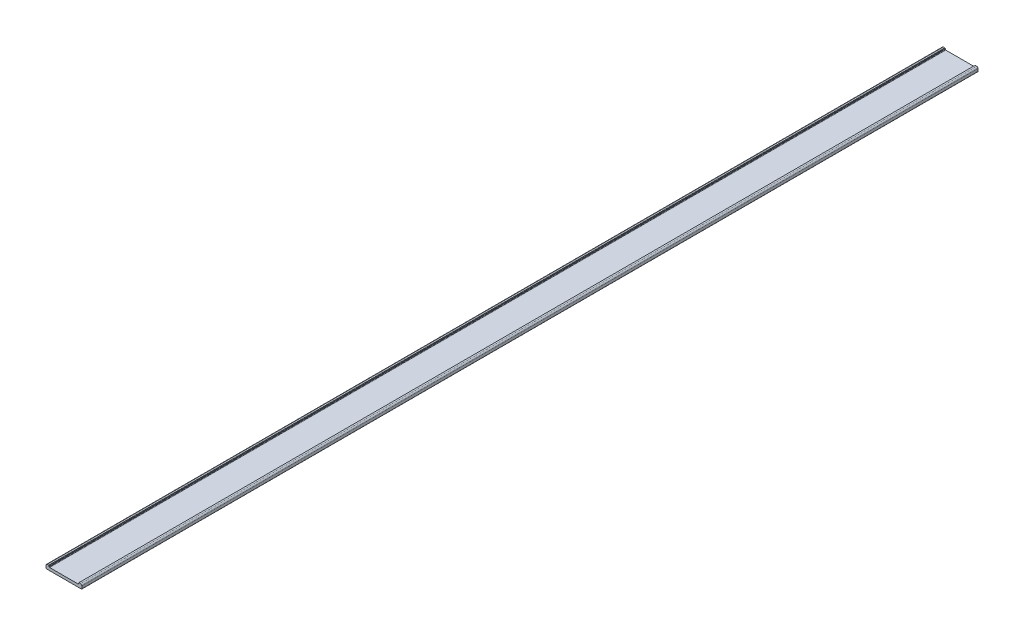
ISO-10303-21;
HEADER;
FILE_DESCRIPTION(('STEP AP214'),'2;1');
FILE_NAME('part.step','',(''),(''),'','','');
FILE_SCHEMA(('AUTOMOTIVE_DESIGN { 1 0 10303 214 1 1 1 1 }'));
ENDSEC;
DATA;
#1=APPLICATION_CONTEXT('core data for automotive mechanical design processes');
#2=APPLICATION_PROTOCOL_DEFINITION('international standard','automotive_design',2000,#1);
#3=PRODUCT_CONTEXT('',#1,'mechanical');
#4=PRODUCT('Part','Part','',(#3));
#5=PRODUCT_RELATED_PRODUCT_CATEGORY('part','',(#4));
#6=PRODUCT_DEFINITION_FORMATION('','',#4);
#7=PRODUCT_DEFINITION_CONTEXT('part definition',#1,'design');
#8=PRODUCT_DEFINITION('design','',#6,#7);
#9=PRODUCT_DEFINITION_SHAPE('','',#8);
#10=(LENGTH_UNIT() NAMED_UNIT(*) SI_UNIT(.MILLI.,.METRE.));
#11=(NAMED_UNIT(*) PLANE_ANGLE_UNIT() SI_UNIT($,.RADIAN.));
#12=(NAMED_UNIT(*) SI_UNIT($,.STERADIAN.) SOLID_ANGLE_UNIT());
#13=UNCERTAINTY_MEASURE_WITH_UNIT(LENGTH_MEASURE(1.E-05),#10,'distance_accuracy_value','');
#14=(GEOMETRIC_REPRESENTATION_CONTEXT(3) GLOBAL_UNCERTAINTY_ASSIGNED_CONTEXT((#13)) GLOBAL_UNIT_ASSIGNED_CONTEXT((#10,
#11,#12)) REPRESENTATION_CONTEXT('',''));
#15=CARTESIAN_POINT('',(0.,0.,0.));
#16=DIRECTION('',(0.,0.,1.));
#17=DIRECTION('',(1.,0.,0.));
#18=AXIS2_PLACEMENT_3D('',#15,#16,#17);
#19=CARTESIAN_POINT('',(39.5,0.5,-1000.));
#20=DIRECTION('',(0.,0.,1.));
#21=DIRECTION('',(1.,0.,0.));
#22=AXIS2_PLACEMENT_3D('',#19,#20,#21);
#23=CYLINDRICAL_SURFACE('',#22,0.5);
#24=CARTESIAN_POINT('',(39.5,0.5,0.));
#25=DIRECTION('',(0.,0.,1.));
#26=DIRECTION('',(1.,0.,0.));
#27=AXIS2_PLACEMENT_3D('',#24,#25,#26);
#28=CIRCLE('',#27,0.5);
#29=CARTESIAN_POINT('',(39.5,0.,0.));
#30=VERTEX_POINT('',#29);
#31=CARTESIAN_POINT('',(40.,0.500000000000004,0.));
#32=VERTEX_POINT('',#31);
#33=EDGE_CURVE('E190',#30,#32,#28,.T.);
#34=ORIENTED_EDGE('',*,*,#33,.F.);
#35=DIRECTION('',(0.,0.,1.));
#36=VECTOR('',#35,1.);
#37=CARTESIAN_POINT('',(39.5,0.,-1000.));
#38=LINE('',#37,#36);
#39=CARTESIAN_POINT('',(39.5,0.,-1000.));
#40=VERTEX_POINT('',#39);
#41=EDGE_CURVE('E11',#40,#30,#38,.T.);
#42=ORIENTED_EDGE('',*,*,#41,.F.);
#43=CARTESIAN_POINT('',(39.5,0.5,-1000.));
#44=DIRECTION('',(0.,0.,1.));
#45=DIRECTION('',(1.,0.,0.));
#46=AXIS2_PLACEMENT_3D('',#43,#44,#45);
#47=CIRCLE('',#46,0.5);
#48=CARTESIAN_POINT('',(40.,0.500000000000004,-1000.));
#49=VERTEX_POINT('',#48);
#50=EDGE_CURVE('E234',#40,#49,#47,.T.);
#51=ORIENTED_EDGE('',*,*,#50,.T.);
#52=DIRECTION('',(0.,0.,1.));
#53=VECTOR('',#52,1.);
#54=CARTESIAN_POINT('',(40.,0.500000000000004,-1000.));
#55=LINE('',#54,#53);
#56=EDGE_CURVE('E46',#49,#32,#55,.T.);
#57=ORIENTED_EDGE('',*,*,#56,.T.);
#58=EDGE_LOOP('',(#34,#42,#51,#57));
#59=FACE_BOUND('',#58,.T.);
#60=ADVANCED_FACE('F43',(#59),#23,.T.);
#61=CARTESIAN_POINT('',(0.500000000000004,0.,-1000.));
#62=DIRECTION('',(0.,-1.,0.));
#63=DIRECTION('',(0.,0.,-1.));
#64=AXIS2_PLACEMENT_3D('',#61,#62,#63);
#65=PLANE('',#64);
#66=DIRECTION('',(1.,0.,0.));
#67=VECTOR('',#66,1.);
#68=CARTESIAN_POINT('',(0.500000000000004,0.,0.));
#69=LINE('',#68,#67);
#70=CARTESIAN_POINT('',(0.500000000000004,0.,0.));
#71=VERTEX_POINT('',#70);
#72=EDGE_CURVE('E232',#71,#30,#69,.T.);
#73=ORIENTED_EDGE('',*,*,#72,.F.);
#74=DIRECTION('',(0.,0.,1.));
#75=VECTOR('',#74,1.);
#76=CARTESIAN_POINT('',(0.500000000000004,0.,-1000.));
#77=LINE('',#76,#75);
#78=CARTESIAN_POINT('',(0.500000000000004,0.,-1000.));
#79=VERTEX_POINT('',#78);
#80=EDGE_CURVE('E53',#79,#71,#77,.T.);
#81=ORIENTED_EDGE('',*,*,#80,.F.);
#82=DIRECTION('',(1.,0.,0.));
#83=VECTOR('',#82,1.);
#84=CARTESIAN_POINT('',(0.500000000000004,0.,-1000.));
#85=LINE('',#84,#83);
#86=EDGE_CURVE('E180',#79,#40,#85,.T.);
#87=ORIENTED_EDGE('',*,*,#86,.T.);
#88=ORIENTED_EDGE('',*,*,#41,.T.);
#89=EDGE_LOOP('',(#73,#81,#87,#88));
#90=FACE_BOUND('',#89,.T.);
#91=ADVANCED_FACE('F276',(#90),#65,.T.);
#92=CARTESIAN_POINT('',(0.5,0.5,-1000.));
#93=DIRECTION('',(0.,0.,1.));
#94=DIRECTION('',(1.,0.,0.));
#95=AXIS2_PLACEMENT_3D('',#92,#93,#94);
#96=CYLINDRICAL_SURFACE('',#95,0.5);
#97=CARTESIAN_POINT('',(0.5,0.5,0.));
#98=DIRECTION('',(0.,0.,1.));
#99=DIRECTION('',(1.,0.,0.));
#100=AXIS2_PLACEMENT_3D('',#97,#98,#99);
#101=CIRCLE('',#100,0.5);
#102=CARTESIAN_POINT('',(0.,0.500000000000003,0.));
#103=VERTEX_POINT('',#102);
#104=EDGE_CURVE('E166',#103,#71,#101,.T.);
#105=ORIENTED_EDGE('',*,*,#104,.F.);
#106=DIRECTION('',(0.,0.,1.));
#107=VECTOR('',#106,1.);
#108=CARTESIAN_POINT('',(0.,0.500000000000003,-1000.));
#109=LINE('',#108,#107);
#110=CARTESIAN_POINT('',(0.,0.500000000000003,-1000.));
#111=VERTEX_POINT('',#110);
#112=EDGE_CURVE('E161',#111,#103,#109,.T.);
#113=ORIENTED_EDGE('',*,*,#112,.F.);
#114=CARTESIAN_POINT('',(0.5,0.5,-1000.));
#115=DIRECTION('',(0.,0.,1.));
#116=DIRECTION('',(1.,0.,0.));
#117=AXIS2_PLACEMENT_3D('',#114,#115,#116);
#118=CIRCLE('',#117,0.5);
#119=EDGE_CURVE('E164',#111,#79,#118,.T.);
#120=ORIENTED_EDGE('',*,*,#119,.T.);
#121=ORIENTED_EDGE('',*,*,#80,.T.);
#122=EDGE_LOOP('',(#105,#113,#120,#121));
#123=FACE_BOUND('',#122,.T.);
#124=ADVANCED_FACE('F163',(#123),#96,.T.);
#125=CARTESIAN_POINT('',(0.,0.500000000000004,-1000.));
#126=DIRECTION('',(-1.,0.,0.));
#127=DIRECTION('',(0.,0.,1.));
#128=AXIS2_PLACEMENT_3D('',#125,#126,#127);
#129=PLANE('',#128);
#130=DIRECTION('',(0.,-1.,0.));
#131=VECTOR('',#130,1.);
#132=CARTESIAN_POINT('',(0.,0.500000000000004,0.));
#133=LINE('',#132,#131);
#134=CARTESIAN_POINT('',(0.,3.3,0.));
#135=VERTEX_POINT('',#134);
#136=EDGE_CURVE('E229',#135,#103,#133,.T.);
#137=ORIENTED_EDGE('',*,*,#136,.F.);
#138=DIRECTION('',(0.,0.,1.));
#139=VECTOR('',#138,1.);
#140=CARTESIAN_POINT('',(0.,3.3,-1000.));
#141=LINE('',#140,#139);
#142=CARTESIAN_POINT('',(0.,3.3,-1000.));
#143=VERTEX_POINT('',#142);
#144=EDGE_CURVE('E172',#143,#135,#141,.T.);
#145=ORIENTED_EDGE('',*,*,#144,.F.);
#146=DIRECTION('',(0.,-1.,0.));
#147=VECTOR('',#146,1.);
#148=CARTESIAN_POINT('',(0.,0.500000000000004,-1000.));
#149=LINE('',#148,#147);
#150=EDGE_CURVE('E178',#143,#111,#149,.T.);
#151=ORIENTED_EDGE('',*,*,#150,.T.);
#152=ORIENTED_EDGE('',*,*,#112,.T.);
#153=EDGE_LOOP('',(#137,#145,#151,#152));
#154=FACE_BOUND('',#153,.T.);
#155=ADVANCED_FACE('F182',(#154),#129,.T.);
#156=CARTESIAN_POINT('',(1.5,3.3,-1000.));
#157=DIRECTION('',(0.,0.,1.));
#158=DIRECTION('',(1.,0.,0.));
#159=AXIS2_PLACEMENT_3D('',#156,#157,#158);
#160=CYLINDRICAL_SURFACE('',#159,1.5);
#161=CARTESIAN_POINT('',(1.5,3.3,0.));
#162=DIRECTION('',(0.,0.,1.));
#163=DIRECTION('',(-1.,0.,0.));
#164=AXIS2_PLACEMENT_3D('',#161,#162,#163);
#165=CIRCLE('',#164,1.5);
#166=CARTESIAN_POINT('',(1.5,4.8,0.));
#167=VERTEX_POINT('',#166);
#168=EDGE_CURVE('E226',#167,#135,#165,.T.);
#169=ORIENTED_EDGE('',*,*,#168,.F.);
#170=DIRECTION('',(0.,0.,1.));
#171=VECTOR('',#170,1.);
#172=CARTESIAN_POINT('',(1.5,4.8,-1000.));
#173=LINE('',#172,#171);
#174=CARTESIAN_POINT('',(1.5,4.8,-1000.));
#175=VERTEX_POINT('',#174);
#176=EDGE_CURVE('E240',#175,#167,#173,.T.);
#177=ORIENTED_EDGE('',*,*,#176,.F.);
#178=CARTESIAN_POINT('',(1.5,3.3,-1000.));
#179=DIRECTION('',(0.,0.,1.));
#180=DIRECTION('',(-1.,0.,0.));
#181=AXIS2_PLACEMENT_3D('',#178,#179,#180);
#182=CIRCLE('',#181,1.5);
#183=EDGE_CURVE('E183',#175,#143,#182,.T.);
#184=ORIENTED_EDGE('',*,*,#183,.T.);
#185=ORIENTED_EDGE('',*,*,#144,.T.);
#186=EDGE_LOOP('',(#169,#177,#184,#185));
#187=FACE_BOUND('',#186,.T.);
#188=ADVANCED_FACE('F289',(#187),#160,.T.);
#189=CARTESIAN_POINT('',(1.5,4.8,-1000.));
#190=DIRECTION('',(0.,1.,0.));
#191=DIRECTION('',(-1.,0.,0.));
#192=AXIS2_PLACEMENT_3D('',#189,#190,#191);
#193=PLANE('',#192);
#194=DIRECTION('',(-1.,0.,0.));
#195=VECTOR('',#194,1.);
#196=CARTESIAN_POINT('',(1.5,4.8,0.));
#197=LINE('',#196,#195);
#198=CARTESIAN_POINT('',(3.,4.8,0.));
#199=VERTEX_POINT('',#198);
#200=EDGE_CURVE('E223',#199,#167,#197,.T.);
#201=ORIENTED_EDGE('',*,*,#200,.F.);
#202=DIRECTION('',(0.,0.,1.));
#203=VECTOR('',#202,1.);
#204=CARTESIAN_POINT('',(3.,4.8,-1000.));
#205=LINE('',#204,#203);
#206=CARTESIAN_POINT('',(3.,4.8,-1000.));
#207=VERTEX_POINT('',#206);
#208=EDGE_CURVE('E243',#207,#199,#205,.T.);
#209=ORIENTED_EDGE('',*,*,#208,.F.);
#210=DIRECTION('',(-1.,0.,0.));
#211=VECTOR('',#210,1.);
#212=CARTESIAN_POINT('',(1.5,4.8,-1000.));
#213=LINE('',#212,#211);
#214=EDGE_CURVE('E185',#207,#175,#213,.T.);
#215=ORIENTED_EDGE('',*,*,#214,.T.);
#216=ORIENTED_EDGE('',*,*,#176,.T.);
#217=EDGE_LOOP('',(#201,#209,#215,#216));
#218=FACE_BOUND('',#217,.T.);
#219=ADVANCED_FACE('F292',(#218),#193,.T.);
#220=CARTESIAN_POINT('',(3.,4.8,-1000.));
#221=DIRECTION('',(0.707106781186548,0.707106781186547,0.));
#222=DIRECTION('',(-0.707106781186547,0.707106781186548,0.));
#223=AXIS2_PLACEMENT_3D('',#220,#221,#222);
#224=PLANE('',#223);
#225=DIRECTION('',(-0.707106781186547,0.707106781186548,0.));
#226=VECTOR('',#225,1.);
#227=CARTESIAN_POINT('',(3.,4.8,0.));
#228=LINE('',#227,#226);
#229=CARTESIAN_POINT('',(3.5,4.3,0.));
#230=VERTEX_POINT('',#229);
#231=EDGE_CURVE('E220',#230,#199,#228,.T.);
#232=ORIENTED_EDGE('',*,*,#231,.F.);
#233=DIRECTION('',(0.,0.,1.));
#234=VECTOR('',#233,1.);
#235=CARTESIAN_POINT('',(3.5,4.3,-1000.));
#236=LINE('',#235,#234);
#237=CARTESIAN_POINT('',(3.5,4.3,-1000.));
#238=VERTEX_POINT('',#237);
#239=EDGE_CURVE('E246',#238,#230,#236,.T.);
#240=ORIENTED_EDGE('',*,*,#239,.F.);
#241=DIRECTION('',(-0.707106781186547,0.707106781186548,0.));
#242=VECTOR('',#241,1.);
#243=CARTESIAN_POINT('',(3.,4.8,-1000.));
#244=LINE('',#243,#242);
#245=EDGE_CURVE('E473',#238,#207,#244,.T.);
#246=ORIENTED_EDGE('',*,*,#245,.T.);
#247=ORIENTED_EDGE('',*,*,#208,.T.);
#248=EDGE_LOOP('',(#232,#240,#246,#247));
#249=FACE_BOUND('',#248,.T.);
#250=ADVANCED_FACE('F296',(#249),#224,.T.);
#251=CARTESIAN_POINT('',(3.5,4.3,-1000.));
#252=DIRECTION('',(1.,0.,0.));
#253=DIRECTION('',(0.,1.,0.));
#254=AXIS2_PLACEMENT_3D('',#251,#252,#253);
#255=PLANE('',#254);
#256=DIRECTION('',(0.,1.,0.));
#257=VECTOR('',#256,1.);
#258=CARTESIAN_POINT('',(3.5,4.3,0.));
#259=LINE('',#258,#257);
#260=CARTESIAN_POINT('',(3.5,3.6,0.));
#261=VERTEX_POINT('',#260);
#262=EDGE_CURVE('E217',#261,#230,#259,.T.);
#263=ORIENTED_EDGE('',*,*,#262,.F.);
#264=DIRECTION('',(0.,0.,1.));
#265=VECTOR('',#264,1.);
#266=CARTESIAN_POINT('',(3.5,3.6,-1000.));
#267=LINE('',#266,#265);
#268=CARTESIAN_POINT('',(3.5,3.6,-1000.));
#269=VERTEX_POINT('',#268);
#270=EDGE_CURVE('E249',#269,#261,#267,.T.);
#271=ORIENTED_EDGE('',*,*,#270,.F.);
#272=DIRECTION('',(0.,1.,0.));
#273=VECTOR('',#272,1.);
#274=CARTESIAN_POINT('',(3.5,4.3,-1000.));
#275=LINE('',#274,#273);
#276=EDGE_CURVE('E469',#269,#238,#275,.T.);
#277=ORIENTED_EDGE('',*,*,#276,.T.);
#278=ORIENTED_EDGE('',*,*,#239,.T.);
#279=EDGE_LOOP('',(#263,#271,#277,#278));
#280=FACE_BOUND('',#279,.T.);
#281=ADVANCED_FACE('F300',(#280),#255,.T.);
#282=CARTESIAN_POINT('',(4.,3.6,-1000.));
#283=DIRECTION('',(0.,0.,1.));
#284=DIRECTION('',(1.,0.,0.));
#285=AXIS2_PLACEMENT_3D('',#282,#283,#284);
#286=CYLINDRICAL_SURFACE('',#285,0.5);
#287=CARTESIAN_POINT('',(4.,3.6,0.));
#288=DIRECTION('',(0.,0.,-1.));
#289=DIRECTION('',(1.,0.,0.));
#290=AXIS2_PLACEMENT_3D('',#287,#288,#289);
#291=CIRCLE('',#290,0.5);
#292=CARTESIAN_POINT('',(4.,3.1,0.));
#293=VERTEX_POINT('',#292);
#294=EDGE_CURVE('E214',#293,#261,#291,.T.);
#295=ORIENTED_EDGE('',*,*,#294,.F.);
#296=DIRECTION('',(0.,0.,1.));
#297=VECTOR('',#296,1.);
#298=CARTESIAN_POINT('',(4.,3.1,-1000.));
#299=LINE('',#298,#297);
#300=CARTESIAN_POINT('',(4.,3.1,-1000.));
#301=VERTEX_POINT('',#300);
#302=EDGE_CURVE('E252',#301,#293,#299,.T.);
#303=ORIENTED_EDGE('',*,*,#302,.F.);
#304=CARTESIAN_POINT('',(4.,3.6,-1000.));
#305=DIRECTION('',(0.,0.,-1.));
#306=DIRECTION('',(1.,0.,0.));
#307=AXIS2_PLACEMENT_3D('',#304,#305,#306);
#308=CIRCLE('',#307,0.5);
#309=EDGE_CURVE('E480',#301,#269,#308,.T.);
#310=ORIENTED_EDGE('',*,*,#309,.T.);
#311=ORIENTED_EDGE('',*,*,#270,.T.);
#312=EDGE_LOOP('',(#295,#303,#310,#311));
#313=FACE_BOUND('',#312,.T.);
#314=ADVANCED_FACE('F304',(#313),#286,.F.);
#315=CARTESIAN_POINT('',(4.,3.1,-1000.));
#316=DIRECTION('',(0.,1.,0.));
#317=DIRECTION('',(0.,0.,1.));
#318=AXIS2_PLACEMENT_3D('',#315,#316,#317);
#319=PLANE('',#318);
#320=DIRECTION('',(-1.,0.,0.));
#321=VECTOR('',#320,1.);
#322=CARTESIAN_POINT('',(4.,3.1,0.));
#323=LINE('',#322,#321);
#324=CARTESIAN_POINT('',(36.,3.1,0.));
#325=VERTEX_POINT('',#324);
#326=EDGE_CURVE('E211',#325,#293,#323,.T.);
#327=ORIENTED_EDGE('',*,*,#326,.F.);
#328=DIRECTION('',(0.,0.,1.));
#329=VECTOR('',#328,1.);
#330=CARTESIAN_POINT('',(36.,3.1,-1000.));
#331=LINE('',#330,#329);
#332=CARTESIAN_POINT('',(36.,3.1,-1000.));
#333=VERTEX_POINT('',#332);
#334=EDGE_CURVE('E255',#333,#325,#331,.T.);
#335=ORIENTED_EDGE('',*,*,#334,.F.);
#336=DIRECTION('',(-1.,0.,0.));
#337=VECTOR('',#336,1.);
#338=CARTESIAN_POINT('',(4.,3.1,-1000.));
#339=LINE('',#338,#337);
#340=EDGE_CURVE('E462',#333,#301,#339,.T.);
#341=ORIENTED_EDGE('',*,*,#340,.T.);
#342=ORIENTED_EDGE('',*,*,#302,.T.);
#343=EDGE_LOOP('',(#327,#335,#341,#342));
#344=FACE_BOUND('',#343,.T.);
#345=ADVANCED_FACE('F308',(#344),#319,.T.);
#346=CARTESIAN_POINT('',(36.,3.6,-1000.));
#347=DIRECTION('',(0.,0.,1.));
#348=DIRECTION('',(1.,0.,0.));
#349=AXIS2_PLACEMENT_3D('',#346,#347,#348);
#350=CYLINDRICAL_SURFACE('',#349,0.5);
#351=CARTESIAN_POINT('',(36.,3.6,0.));
#352=DIRECTION('',(0.,0.,-1.));
#353=DIRECTION('',(-1.,0.,0.));
#354=AXIS2_PLACEMENT_3D('',#351,#352,#353);
#355=CIRCLE('',#354,0.5);
#356=CARTESIAN_POINT('',(36.5,3.6,0.));
#357=VERTEX_POINT('',#356);
#358=EDGE_CURVE('E208',#357,#325,#355,.T.);
#359=ORIENTED_EDGE('',*,*,#358,.F.);
#360=DIRECTION('',(0.,0.,1.));
#361=VECTOR('',#360,1.);
#362=CARTESIAN_POINT('',(36.5,3.6,-1000.));
#363=LINE('',#362,#361);
#364=CARTESIAN_POINT('',(36.5,3.6,-1000.));
#365=VERTEX_POINT('',#364);
#366=EDGE_CURVE('E258',#365,#357,#363,.T.);
#367=ORIENTED_EDGE('',*,*,#366,.F.);
#368=CARTESIAN_POINT('',(36.,3.6,-1000.));
#369=DIRECTION('',(0.,0.,-1.));
#370=DIRECTION('',(-1.,0.,0.));
#371=AXIS2_PLACEMENT_3D('',#368,#369,#370);
#372=CIRCLE('',#371,0.5);
#373=EDGE_CURVE('E458',#365,#333,#372,.T.);
#374=ORIENTED_EDGE('',*,*,#373,.T.);
#375=ORIENTED_EDGE('',*,*,#334,.T.);
#376=EDGE_LOOP('',(#359,#367,#374,#375));
#377=FACE_BOUND('',#376,.T.);
#378=ADVANCED_FACE('F312',(#377),#350,.F.);
#379=CARTESIAN_POINT('',(36.5,4.55,-1000.));
#380=DIRECTION('',(-1.,0.,0.));
#381=DIRECTION('',(0.,0.,1.));
#382=AXIS2_PLACEMENT_3D('',#379,#380,#381);
#383=PLANE('',#382);
#384=DIRECTION('',(0.,-1.,0.));
#385=VECTOR('',#384,1.);
#386=CARTESIAN_POINT('',(36.5,4.55,0.));
#387=LINE('',#386,#385);
#388=CARTESIAN_POINT('',(36.5,4.55,0.));
#389=VERTEX_POINT('',#388);
#390=EDGE_CURVE('E205',#389,#357,#387,.T.);
#391=ORIENTED_EDGE('',*,*,#390,.F.);
#392=DIRECTION('',(0.,0.,1.));
#393=VECTOR('',#392,1.);
#394=CARTESIAN_POINT('',(36.5,4.55,-1000.));
#395=LINE('',#394,#393);
#396=CARTESIAN_POINT('',(36.5,4.55,-1000.));
#397=VERTEX_POINT('',#396);
#398=EDGE_CURVE('E261',#397,#389,#395,.T.);
#399=ORIENTED_EDGE('',*,*,#398,.F.);
#400=DIRECTION('',(0.,-1.,0.));
#401=VECTOR('',#400,1.);
#402=CARTESIAN_POINT('',(36.5,4.55,-1000.));
#403=LINE('',#402,#401);
#404=EDGE_CURVE('E484',#397,#365,#403,.T.);
#405=ORIENTED_EDGE('',*,*,#404,.T.);
#406=ORIENTED_EDGE('',*,*,#366,.T.);
#407=EDGE_LOOP('',(#391,#399,#405,#406));
#408=FACE_BOUND('',#407,.T.);
#409=ADVANCED_FACE('F316',(#408),#383,.T.);
#410=CARTESIAN_POINT('',(36.75,4.8,-1000.));
#411=DIRECTION('',(-0.707106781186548,0.707106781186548,0.));
#412=DIRECTION('',(-0.707106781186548,-0.707106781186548,0.));
#413=AXIS2_PLACEMENT_3D('',#410,#411,#412);
#414=PLANE('',#413);
#415=DIRECTION('',(-0.707106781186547,-0.707106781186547,0.));
#416=VECTOR('',#415,1.);
#417=CARTESIAN_POINT('',(36.75,4.8,0.));
#418=LINE('',#417,#416);
#419=CARTESIAN_POINT('',(36.75,4.8,0.));
#420=VERTEX_POINT('',#419);
#421=EDGE_CURVE('E202',#420,#389,#418,.T.);
#422=ORIENTED_EDGE('',*,*,#421,.F.);
#423=DIRECTION('',(0.,0.,1.));
#424=VECTOR('',#423,1.);
#425=CARTESIAN_POINT('',(36.75,4.8,-1000.));
#426=LINE('',#425,#424);
#427=CARTESIAN_POINT('',(36.75,4.8,-1000.));
#428=VERTEX_POINT('',#427);
#429=EDGE_CURVE('E264',#428,#420,#426,.T.);
#430=ORIENTED_EDGE('',*,*,#429,.F.);
#431=DIRECTION('',(-0.707106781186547,-0.707106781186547,0.));
#432=VECTOR('',#431,1.);
#433=CARTESIAN_POINT('',(36.75,4.8,-1000.));
#434=LINE('',#433,#432);
#435=EDGE_CURVE('E451',#428,#397,#434,.T.);
#436=ORIENTED_EDGE('',*,*,#435,.T.);
#437=ORIENTED_EDGE('',*,*,#398,.T.);
#438=EDGE_LOOP('',(#422,#430,#436,#437));
#439=FACE_BOUND('',#438,.T.);
#440=ADVANCED_FACE('F320',(#439),#414,.T.);
#441=CARTESIAN_POINT('',(36.75,4.8,-1000.));
#442=DIRECTION('',(0.,1.,0.));
#443=DIRECTION('',(0.,0.,1.));
#444=AXIS2_PLACEMENT_3D('',#441,#442,#443);
#445=PLANE('',#444);
#446=DIRECTION('',(-1.,0.,0.));
#447=VECTOR('',#446,1.);
#448=CARTESIAN_POINT('',(36.75,4.8,0.));
#449=LINE('',#448,#447);
#450=CARTESIAN_POINT('',(38.5,4.8,0.));
#451=VERTEX_POINT('',#450);
#452=EDGE_CURVE('E199',#451,#420,#449,.T.);
#453=ORIENTED_EDGE('',*,*,#452,.F.);
#454=DIRECTION('',(0.,0.,1.));
#455=VECTOR('',#454,1.);
#456=CARTESIAN_POINT('',(38.5,4.8,-1000.));
#457=LINE('',#456,#455);
#458=CARTESIAN_POINT('',(38.5,4.8,-1000.));
#459=VERTEX_POINT('',#458);
#460=EDGE_CURVE('E267',#459,#451,#457,.T.);
#461=ORIENTED_EDGE('',*,*,#460,.F.);
#462=DIRECTION('',(-1.,0.,0.));
#463=VECTOR('',#462,1.);
#464=CARTESIAN_POINT('',(36.75,4.8,-1000.));
#465=LINE('',#464,#463);
#466=EDGE_CURVE('E447',#459,#428,#465,.T.);
#467=ORIENTED_EDGE('',*,*,#466,.T.);
#468=ORIENTED_EDGE('',*,*,#429,.T.);
#469=EDGE_LOOP('',(#453,#461,#467,#468));
#470=FACE_BOUND('',#469,.T.);
#471=ADVANCED_FACE('F324',(#470),#445,.T.);
#472=CARTESIAN_POINT('',(38.5,3.3,-1000.));
#473=DIRECTION('',(0.,0.,1.));
#474=DIRECTION('',(1.,0.,0.));
#475=AXIS2_PLACEMENT_3D('',#472,#473,#474);
#476=CYLINDRICAL_SURFACE('',#475,1.5);
#477=CARTESIAN_POINT('',(38.5,3.3,0.));
#478=DIRECTION('',(0.,0.,1.));
#479=DIRECTION('',(-1.,0.,0.));
#480=AXIS2_PLACEMENT_3D('',#477,#478,#479);
#481=CIRCLE('',#480,1.5);
#482=CARTESIAN_POINT('',(40.,3.3,0.));
#483=VERTEX_POINT('',#482);
#484=EDGE_CURVE('E196',#483,#451,#481,.T.);
#485=ORIENTED_EDGE('',*,*,#484,.F.);
#486=DIRECTION('',(0.,0.,1.));
#487=VECTOR('',#486,1.);
#488=CARTESIAN_POINT('',(40.,3.3,-1000.));
#489=LINE('',#488,#487);
#490=CARTESIAN_POINT('',(40.,3.3,-1000.));
#491=VERTEX_POINT('',#490);
#492=EDGE_CURVE('E269',#491,#483,#489,.T.);
#493=ORIENTED_EDGE('',*,*,#492,.F.);
#494=CARTESIAN_POINT('',(38.5,3.3,-1000.));
#495=DIRECTION('',(0.,0.,1.));
#496=DIRECTION('',(-1.,0.,0.));
#497=AXIS2_PLACEMENT_3D('',#494,#495,#496);
#498=CIRCLE('',#497,1.5);
#499=EDGE_CURVE('E488',#491,#459,#498,.T.);
#500=ORIENTED_EDGE('',*,*,#499,.T.);
#501=ORIENTED_EDGE('',*,*,#460,.T.);
#502=EDGE_LOOP('',(#485,#493,#500,#501));
#503=FACE_BOUND('',#502,.T.);
#504=ADVANCED_FACE('F328',(#503),#476,.T.);
#505=CARTESIAN_POINT('',(40.,0.500000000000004,-1000.));
#506=DIRECTION('',(1.,0.,0.));
#507=DIRECTION('',(0.,0.,-1.));
#508=AXIS2_PLACEMENT_3D('',#505,#506,#507);
#509=PLANE('',#508);
#510=DIRECTION('',(0.,1.,0.));
#511=VECTOR('',#510,1.);
#512=CARTESIAN_POINT('',(40.,0.500000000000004,0.));
#513=LINE('',#512,#511);
#514=EDGE_CURVE('E193',#32,#483,#513,.T.);
#515=ORIENTED_EDGE('',*,*,#514,.F.);
#516=ORIENTED_EDGE('',*,*,#56,.F.);
#517=DIRECTION('',(0.,1.,0.));
#518=VECTOR('',#517,1.);
#519=CARTESIAN_POINT('',(40.,0.500000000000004,-1000.));
#520=LINE('',#519,#518);
#521=EDGE_CURVE('E490',#49,#491,#520,.T.);
#522=ORIENTED_EDGE('',*,*,#521,.T.);
#523=ORIENTED_EDGE('',*,*,#492,.T.);
#524=EDGE_LOOP('',(#515,#516,#522,#523));
#525=FACE_BOUND('',#524,.T.);
#526=ADVANCED_FACE('F273',(#525),#509,.T.);
#527=CARTESIAN_POINT('',(39.5,0.5,-1000.));
#528=DIRECTION('',(0.,0.,1.));
#529=DIRECTION('',(1.,0.,0.));
#530=AXIS2_PLACEMENT_3D('',#527,#528,#529);
#531=PLANE('',#530);
#532=ORIENTED_EDGE('',*,*,#50,.F.);
#533=ORIENTED_EDGE('',*,*,#86,.F.);
#534=ORIENTED_EDGE('',*,*,#119,.F.);
#535=ORIENTED_EDGE('',*,*,#150,.F.);
#536=ORIENTED_EDGE('',*,*,#183,.F.);
#537=ORIENTED_EDGE('',*,*,#214,.F.);
#538=ORIENTED_EDGE('',*,*,#245,.F.);
#539=ORIENTED_EDGE('',*,*,#276,.F.);
#540=ORIENTED_EDGE('',*,*,#309,.F.);
#541=ORIENTED_EDGE('',*,*,#340,.F.);
#542=ORIENTED_EDGE('',*,*,#373,.F.);
#543=ORIENTED_EDGE('',*,*,#404,.F.);
#544=ORIENTED_EDGE('',*,*,#435,.F.);
#545=ORIENTED_EDGE('',*,*,#466,.F.);
#546=ORIENTED_EDGE('',*,*,#499,.F.);
#547=ORIENTED_EDGE('',*,*,#521,.F.);
#548=EDGE_LOOP('',(#532,#533,#534,#535,#536,#537,#538,#539,#540,#541,#542,#543,#544,#545,#546,#547));
#549=FACE_BOUND('',#548,.T.);
#550=ADVANCED_FACE('F176',(#549),#531,.F.);
#551=CARTESIAN_POINT('',(39.5,0.5,0.));
#552=DIRECTION('',(0.,0.,1.));
#553=DIRECTION('',(1.,0.,0.));
#554=AXIS2_PLACEMENT_3D('',#551,#552,#553);
#555=PLANE('',#554);
#556=ORIENTED_EDGE('',*,*,#33,.T.);
#557=ORIENTED_EDGE('',*,*,#514,.T.);
#558=ORIENTED_EDGE('',*,*,#484,.T.);
#559=ORIENTED_EDGE('',*,*,#452,.T.);
#560=ORIENTED_EDGE('',*,*,#421,.T.);
#561=ORIENTED_EDGE('',*,*,#390,.T.);
#562=ORIENTED_EDGE('',*,*,#358,.T.);
#563=ORIENTED_EDGE('',*,*,#326,.T.);
#564=ORIENTED_EDGE('',*,*,#294,.T.);
#565=ORIENTED_EDGE('',*,*,#262,.T.);
#566=ORIENTED_EDGE('',*,*,#231,.T.);
#567=ORIENTED_EDGE('',*,*,#200,.T.);
#568=ORIENTED_EDGE('',*,*,#168,.T.);
#569=ORIENTED_EDGE('',*,*,#136,.T.);
#570=ORIENTED_EDGE('',*,*,#104,.T.);
#571=ORIENTED_EDGE('',*,*,#72,.T.);
#572=EDGE_LOOP('',(#556,#557,#558,#559,#560,#561,#562,#563,#564,#565,#566,#567,#568,#569,#570,#571));
#573=FACE_BOUND('',#572,.T.);
#574=ADVANCED_FACE('F275',(#573),#555,.T.);
#575=CLOSED_SHELL('',(#60,#91,#124,#155,#188,#219,#250,#281,#314,#345,#378,#409,#440,#471,#504,
#526,#550,#574));
#576=MANIFOLD_SOLID_BREP('B2',#575);
#577=ADVANCED_BREP_SHAPE_REPRESENTATION('',(#18,#576),#14);
#578=SHAPE_DEFINITION_REPRESENTATION(#9,#577);
ENDSEC;
END-ISO-10303-21;
